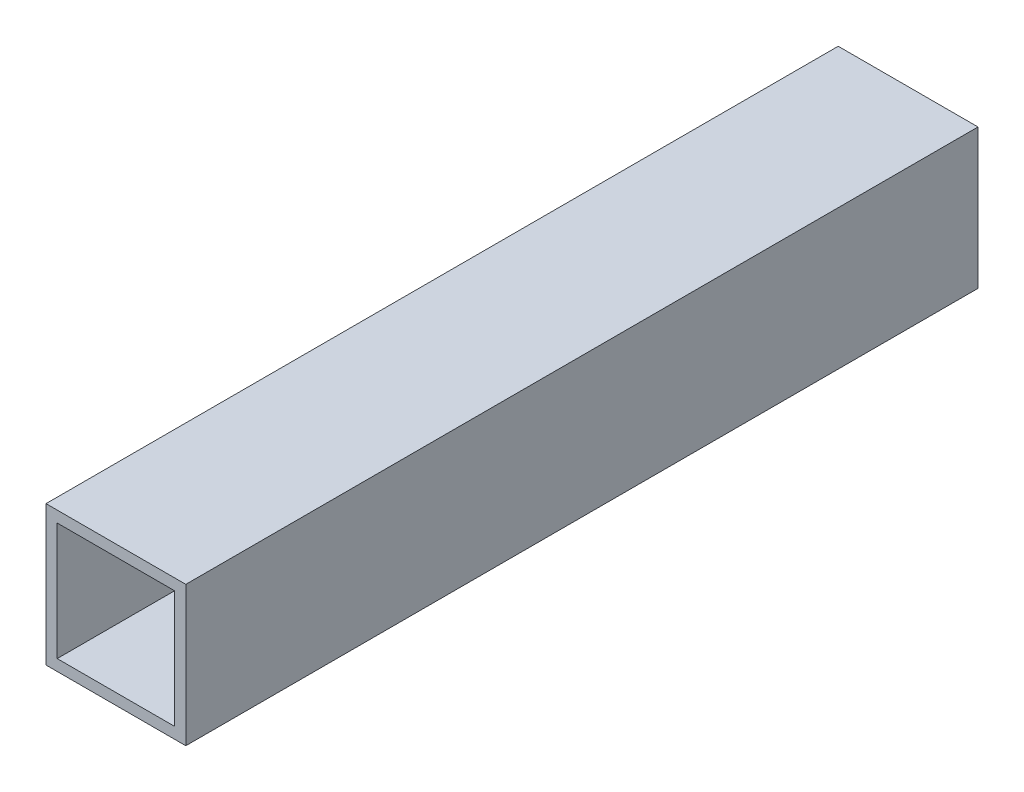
ISO-10303-21;
HEADER;
FILE_DESCRIPTION(('STEP AP214'),'2;1');
FILE_NAME('part.step','',(''),(''),'','','');
FILE_SCHEMA(('AUTOMOTIVE_DESIGN { 1 0 10303 214 1 1 1 1 }'));
ENDSEC;
DATA;
#1=APPLICATION_CONTEXT('core data for automotive mechanical design processes');
#2=APPLICATION_PROTOCOL_DEFINITION('international standard','automotive_design',2000,#1);
#3=PRODUCT_CONTEXT('',#1,'mechanical');
#4=PRODUCT('Part','Part','',(#3));
#5=PRODUCT_RELATED_PRODUCT_CATEGORY('part','',(#4));
#6=PRODUCT_DEFINITION_FORMATION('','',#4);
#7=PRODUCT_DEFINITION_CONTEXT('part definition',#1,'design');
#8=PRODUCT_DEFINITION('design','',#6,#7);
#9=PRODUCT_DEFINITION_SHAPE('','',#8);
#10=(LENGTH_UNIT() NAMED_UNIT(*) SI_UNIT(.MILLI.,.METRE.));
#11=(NAMED_UNIT(*) PLANE_ANGLE_UNIT() SI_UNIT($,.RADIAN.));
#12=(NAMED_UNIT(*) SI_UNIT($,.STERADIAN.) SOLID_ANGLE_UNIT());
#13=UNCERTAINTY_MEASURE_WITH_UNIT(LENGTH_MEASURE(1.E-05),#10,'distance_accuracy_value','');
#14=(GEOMETRIC_REPRESENTATION_CONTEXT(3) GLOBAL_UNCERTAINTY_ASSIGNED_CONTEXT((#13)) GLOBAL_UNIT_ASSIGNED_CONTEXT((#10,
#11,#12)) REPRESENTATION_CONTEXT('',''));
#15=CARTESIAN_POINT('',(0.,0.,0.));
#16=DIRECTION('',(0.,0.,1.));
#17=DIRECTION('',(1.,0.,0.));
#18=AXIS2_PLACEMENT_3D('',#15,#16,#17);
#19=CARTESIAN_POINT('',(0.,0.,850.));
#20=DIRECTION('',(0.,0.,1.));
#21=DIRECTION('',(1.,0.,0.));
#22=AXIS2_PLACEMENT_3D('',#19,#20,#21);
#23=PLANE('',#22);
#24=DIRECTION('',(0.,-1.,0.));
#25=VECTOR('',#24,1.);
#26=CARTESIAN_POINT('',(-63.,63.,850.));
#27=LINE('',#26,#25);
#28=CARTESIAN_POINT('',(-63.,63.,850.));
#29=VERTEX_POINT('',#28);
#30=CARTESIAN_POINT('',(-63.,-63.,850.));
#31=VERTEX_POINT('',#30);
#32=EDGE_CURVE('E20',#29,#31,#27,.T.);
#33=ORIENTED_EDGE('',*,*,#32,.F.);
#34=DIRECTION('',(-1.,0.,0.));
#35=VECTOR('',#34,1.);
#36=CARTESIAN_POINT('',(63.,63.,850.));
#37=LINE('',#36,#35);
#38=CARTESIAN_POINT('',(63.,63.,850.));
#39=VERTEX_POINT('',#38);
#40=EDGE_CURVE('E75',#39,#29,#37,.T.);
#41=ORIENTED_EDGE('',*,*,#40,.F.);
#42=DIRECTION('',(0.,1.,0.));
#43=VECTOR('',#42,1.);
#44=CARTESIAN_POINT('',(63.,-63.,850.));
#45=LINE('',#44,#43);
#46=CARTESIAN_POINT('',(63.,-63.,850.));
#47=VERTEX_POINT('',#46);
#48=EDGE_CURVE('E103',#47,#39,#45,.T.);
#49=ORIENTED_EDGE('',*,*,#48,.F.);
#50=DIRECTION('',(1.,0.,0.));
#51=VECTOR('',#50,1.);
#52=CARTESIAN_POINT('',(-63.,-63.,850.));
#53=LINE('',#52,#51);
#54=EDGE_CURVE('E120',#31,#47,#53,.T.);
#55=ORIENTED_EDGE('',*,*,#54,.F.);
#56=EDGE_LOOP('',(#33,#41,#49,#55));
#57=FACE_BOUND('',#56,.T.);
#58=DIRECTION('',(1.,0.,0.));
#59=VECTOR('',#58,1.);
#60=CARTESIAN_POINT('',(-75.,-75.,850.));
#61=LINE('',#60,#59);
#62=CARTESIAN_POINT('',(-75.,-75.,850.));
#63=VERTEX_POINT('',#62);
#64=CARTESIAN_POINT('',(75.,-75.,850.));
#65=VERTEX_POINT('',#64);
#66=EDGE_CURVE('E166',#63,#65,#61,.T.);
#67=ORIENTED_EDGE('',*,*,#66,.T.);
#68=DIRECTION('',(0.,1.,0.));
#69=VECTOR('',#68,1.);
#70=CARTESIAN_POINT('',(75.,-75.,850.));
#71=LINE('',#70,#69);
#72=CARTESIAN_POINT('',(75.,75.,850.));
#73=VERTEX_POINT('',#72);
#74=EDGE_CURVE('E150',#65,#73,#71,.T.);
#75=ORIENTED_EDGE('',*,*,#74,.T.);
#76=DIRECTION('',(-1.,0.,0.));
#77=VECTOR('',#76,1.);
#78=CARTESIAN_POINT('',(75.,75.,850.));
#79=LINE('',#78,#77);
#80=CARTESIAN_POINT('',(-75.,75.,850.));
#81=VERTEX_POINT('',#80);
#82=EDGE_CURVE('E138',#73,#81,#79,.T.);
#83=ORIENTED_EDGE('',*,*,#82,.T.);
#84=DIRECTION('',(0.,-1.,0.));
#85=VECTOR('',#84,1.);
#86=CARTESIAN_POINT('',(-75.,75.,850.));
#87=LINE('',#86,#85);
#88=EDGE_CURVE('E128',#81,#63,#87,.T.);
#89=ORIENTED_EDGE('',*,*,#88,.T.);
#90=EDGE_LOOP('',(#67,#75,#83,#89));
#91=FACE_BOUND('',#90,.T.);
#92=ADVANCED_FACE('F16',(#57,#91),#23,.T.);
#93=CARTESIAN_POINT('',(0.,0.,0.));
#94=DIRECTION('',(0.,0.,1.));
#95=DIRECTION('',(1.,0.,0.));
#96=AXIS2_PLACEMENT_3D('',#93,#94,#95);
#97=PLANE('',#96);
#98=DIRECTION('',(1.,0.,0.));
#99=VECTOR('',#98,1.);
#100=CARTESIAN_POINT('',(-63.,-63.,0.));
#101=LINE('',#100,#99);
#102=CARTESIAN_POINT('',(-63.,-63.,0.));
#103=VERTEX_POINT('',#102);
#104=CARTESIAN_POINT('',(63.,-63.,0.));
#105=VERTEX_POINT('',#104);
#106=EDGE_CURVE('E96',#103,#105,#101,.T.);
#107=ORIENTED_EDGE('',*,*,#106,.T.);
#108=DIRECTION('',(0.,1.,0.));
#109=VECTOR('',#108,1.);
#110=CARTESIAN_POINT('',(63.,-63.,0.));
#111=LINE('',#110,#109);
#112=CARTESIAN_POINT('',(63.,63.,0.));
#113=VERTEX_POINT('',#112);
#114=EDGE_CURVE('E92',#105,#113,#111,.T.);
#115=ORIENTED_EDGE('',*,*,#114,.T.);
#116=DIRECTION('',(-1.,0.,0.));
#117=VECTOR('',#116,1.);
#118=CARTESIAN_POINT('',(63.,63.,0.));
#119=LINE('',#118,#117);
#120=CARTESIAN_POINT('',(-63.,63.,0.));
#121=VERTEX_POINT('',#120);
#122=EDGE_CURVE('E82',#113,#121,#119,.T.);
#123=ORIENTED_EDGE('',*,*,#122,.T.);
#124=DIRECTION('',(0.,-1.,0.));
#125=VECTOR('',#124,1.);
#126=CARTESIAN_POINT('',(-63.,63.,0.));
#127=LINE('',#126,#125);
#128=EDGE_CURVE('E10',#121,#103,#127,.T.);
#129=ORIENTED_EDGE('',*,*,#128,.T.);
#130=EDGE_LOOP('',(#107,#115,#123,#129));
#131=FACE_BOUND('',#130,.T.);
#132=DIRECTION('',(0.,-1.,0.));
#133=VECTOR('',#132,1.);
#134=CARTESIAN_POINT('',(-75.,75.,0.));
#135=LINE('',#134,#133);
#136=CARTESIAN_POINT('',(-75.,75.,0.));
#137=VERTEX_POINT('',#136);
#138=CARTESIAN_POINT('',(-75.,-75.,0.));
#139=VERTEX_POINT('',#138);
#140=EDGE_CURVE('E133',#137,#139,#135,.T.);
#141=ORIENTED_EDGE('',*,*,#140,.F.);
#142=DIRECTION('',(-1.,0.,0.));
#143=VECTOR('',#142,1.);
#144=CARTESIAN_POINT('',(75.,75.,0.));
#145=LINE('',#144,#143);
#146=CARTESIAN_POINT('',(75.,75.,0.));
#147=VERTEX_POINT('',#146);
#148=EDGE_CURVE('E146',#147,#137,#145,.T.);
#149=ORIENTED_EDGE('',*,*,#148,.F.);
#150=DIRECTION('',(0.,1.,0.));
#151=VECTOR('',#150,1.);
#152=CARTESIAN_POINT('',(75.,-75.,0.));
#153=LINE('',#152,#151);
#154=CARTESIAN_POINT('',(75.,-75.,0.));
#155=VERTEX_POINT('',#154);
#156=EDGE_CURVE('E158',#155,#147,#153,.T.);
#157=ORIENTED_EDGE('',*,*,#156,.F.);
#158=DIRECTION('',(1.,0.,0.));
#159=VECTOR('',#158,1.);
#160=CARTESIAN_POINT('',(-75.,-75.,0.));
#161=LINE('',#160,#159);
#162=EDGE_CURVE('E175',#139,#155,#161,.T.);
#163=ORIENTED_EDGE('',*,*,#162,.F.);
#164=EDGE_LOOP('',(#141,#149,#157,#163));
#165=FACE_BOUND('',#164,.T.);
#166=ADVANCED_FACE('F93',(#131,#165),#97,.F.);
#167=CARTESIAN_POINT('',(-63.,63.,0.));
#168=DIRECTION('',(1.,0.,0.));
#169=DIRECTION('',(0.,1.,0.));
#170=AXIS2_PLACEMENT_3D('',#167,#168,#169);
#171=PLANE('',#170);
#172=DIRECTION('',(0.,0.,1.));
#173=VECTOR('',#172,1.);
#174=CARTESIAN_POINT('',(-63.,63.,0.));
#175=LINE('',#174,#173);
#176=EDGE_CURVE('E88',#121,#29,#175,.T.);
#177=ORIENTED_EDGE('',*,*,#176,.T.);
#178=ORIENTED_EDGE('',*,*,#32,.T.);
#179=DIRECTION('',(0.,0.,1.));
#180=VECTOR('',#179,1.);
#181=CARTESIAN_POINT('',(-63.,-63.,0.));
#182=LINE('',#181,#180);
#183=EDGE_CURVE('E117',#103,#31,#182,.T.);
#184=ORIENTED_EDGE('',*,*,#183,.F.);
#185=ORIENTED_EDGE('',*,*,#128,.F.);
#186=EDGE_LOOP('',(#177,#178,#184,#185));
#187=FACE_BOUND('',#186,.T.);
#188=ADVANCED_FACE('F18',(#187),#171,.T.);
#189=CARTESIAN_POINT('',(63.,63.,0.));
#190=DIRECTION('',(0.,-1.,0.));
#191=DIRECTION('',(0.,0.,-1.));
#192=AXIS2_PLACEMENT_3D('',#189,#190,#191);
#193=PLANE('',#192);
#194=DIRECTION('',(0.,0.,1.));
#195=VECTOR('',#194,1.);
#196=CARTESIAN_POINT('',(63.,63.,0.));
#197=LINE('',#196,#195);
#198=EDGE_CURVE('E86',#113,#39,#197,.T.);
#199=ORIENTED_EDGE('',*,*,#198,.T.);
#200=ORIENTED_EDGE('',*,*,#40,.T.);
#201=ORIENTED_EDGE('',*,*,#176,.F.);
#202=ORIENTED_EDGE('',*,*,#122,.F.);
#203=EDGE_LOOP('',(#199,#200,#201,#202));
#204=FACE_BOUND('',#203,.T.);
#205=ADVANCED_FACE('F84',(#204),#193,.T.);
#206=CARTESIAN_POINT('',(63.,-63.,0.));
#207=DIRECTION('',(-1.,0.,0.));
#208=DIRECTION('',(0.,0.,1.));
#209=AXIS2_PLACEMENT_3D('',#206,#207,#208);
#210=PLANE('',#209);
#211=DIRECTION('',(0.,0.,1.));
#212=VECTOR('',#211,1.);
#213=CARTESIAN_POINT('',(63.,-63.,0.));
#214=LINE('',#213,#212);
#215=EDGE_CURVE('E124',#105,#47,#214,.T.);
#216=ORIENTED_EDGE('',*,*,#215,.T.);
#217=ORIENTED_EDGE('',*,*,#48,.T.);
#218=ORIENTED_EDGE('',*,*,#198,.F.);
#219=ORIENTED_EDGE('',*,*,#114,.F.);
#220=EDGE_LOOP('',(#216,#217,#218,#219));
#221=FACE_BOUND('',#220,.T.);
#222=ADVANCED_FACE('F102',(#221),#210,.T.);
#223=CARTESIAN_POINT('',(-63.,-63.,0.));
#224=DIRECTION('',(0.,1.,0.));
#225=DIRECTION('',(1.,0.,0.));
#226=AXIS2_PLACEMENT_3D('',#223,#224,#225);
#227=PLANE('',#226);
#228=ORIENTED_EDGE('',*,*,#183,.T.);
#229=ORIENTED_EDGE('',*,*,#54,.T.);
#230=ORIENTED_EDGE('',*,*,#215,.F.);
#231=ORIENTED_EDGE('',*,*,#106,.F.);
#232=EDGE_LOOP('',(#228,#229,#230,#231));
#233=FACE_BOUND('',#232,.T.);
#234=ADVANCED_FACE('F126',(#233),#227,.T.);
#235=CARTESIAN_POINT('',(-75.,75.,0.));
#236=DIRECTION('',(1.,0.,0.));
#237=DIRECTION('',(0.,1.,0.));
#238=AXIS2_PLACEMENT_3D('',#235,#236,#237);
#239=PLANE('',#238);
#240=ORIENTED_EDGE('',*,*,#140,.T.);
#241=DIRECTION('',(0.,0.,1.));
#242=VECTOR('',#241,1.);
#243=CARTESIAN_POINT('',(-75.,-75.,0.));
#244=LINE('',#243,#242);
#245=EDGE_CURVE('E162',#139,#63,#244,.T.);
#246=ORIENTED_EDGE('',*,*,#245,.T.);
#247=ORIENTED_EDGE('',*,*,#88,.F.);
#248=DIRECTION('',(0.,0.,1.));
#249=VECTOR('',#248,1.);
#250=CARTESIAN_POINT('',(-75.,75.,0.));
#251=LINE('',#250,#249);
#252=EDGE_CURVE('E142',#137,#81,#251,.T.);
#253=ORIENTED_EDGE('',*,*,#252,.F.);
#254=EDGE_LOOP('',(#240,#246,#247,#253));
#255=FACE_BOUND('',#254,.T.);
#256=ADVANCED_FACE('F211',(#255),#239,.F.);
#257=CARTESIAN_POINT('',(75.,75.,0.));
#258=DIRECTION('',(0.,-1.,0.));
#259=DIRECTION('',(0.,0.,-1.));
#260=AXIS2_PLACEMENT_3D('',#257,#258,#259);
#261=PLANE('',#260);
#262=ORIENTED_EDGE('',*,*,#148,.T.);
#263=ORIENTED_EDGE('',*,*,#252,.T.);
#264=ORIENTED_EDGE('',*,*,#82,.F.);
#265=DIRECTION('',(0.,0.,1.));
#266=VECTOR('',#265,1.);
#267=CARTESIAN_POINT('',(75.,75.,0.));
#268=LINE('',#267,#266);
#269=EDGE_CURVE('E153',#147,#73,#268,.T.);
#270=ORIENTED_EDGE('',*,*,#269,.F.);
#271=EDGE_LOOP('',(#262,#263,#264,#270));
#272=FACE_BOUND('',#271,.T.);
#273=ADVANCED_FACE('F213',(#272),#261,.F.);
#274=CARTESIAN_POINT('',(75.,-75.,0.));
#275=DIRECTION('',(-1.,0.,0.));
#276=DIRECTION('',(0.,0.,1.));
#277=AXIS2_PLACEMENT_3D('',#274,#275,#276);
#278=PLANE('',#277);
#279=ORIENTED_EDGE('',*,*,#156,.T.);
#280=ORIENTED_EDGE('',*,*,#269,.T.);
#281=ORIENTED_EDGE('',*,*,#74,.F.);
#282=DIRECTION('',(0.,0.,1.));
#283=VECTOR('',#282,1.);
#284=CARTESIAN_POINT('',(75.,-75.,0.));
#285=LINE('',#284,#283);
#286=EDGE_CURVE('E172',#155,#65,#285,.T.);
#287=ORIENTED_EDGE('',*,*,#286,.F.);
#288=EDGE_LOOP('',(#279,#280,#281,#287));
#289=FACE_BOUND('',#288,.T.);
#290=ADVANCED_FACE('F220',(#289),#278,.F.);
#291=CARTESIAN_POINT('',(-75.,-75.,0.));
#292=DIRECTION('',(0.,1.,0.));
#293=DIRECTION('',(1.,0.,0.));
#294=AXIS2_PLACEMENT_3D('',#291,#292,#293);
#295=PLANE('',#294);
#296=ORIENTED_EDGE('',*,*,#162,.T.);
#297=ORIENTED_EDGE('',*,*,#286,.T.);
#298=ORIENTED_EDGE('',*,*,#66,.F.);
#299=ORIENTED_EDGE('',*,*,#245,.F.);
#300=EDGE_LOOP('',(#296,#297,#298,#299));
#301=FACE_BOUND('',#300,.T.);
#302=ADVANCED_FACE('F186',(#301),#295,.F.);
#303=CLOSED_SHELL('',(#92,#166,#188,#205,#222,#234,#256,#273,#290,#302));
#304=MANIFOLD_SOLID_BREP('B1',#303);
#305=ADVANCED_BREP_SHAPE_REPRESENTATION('',(#18,#304),#14);
#306=SHAPE_DEFINITION_REPRESENTATION(#9,#305);
ENDSEC;
END-ISO-10303-21;
